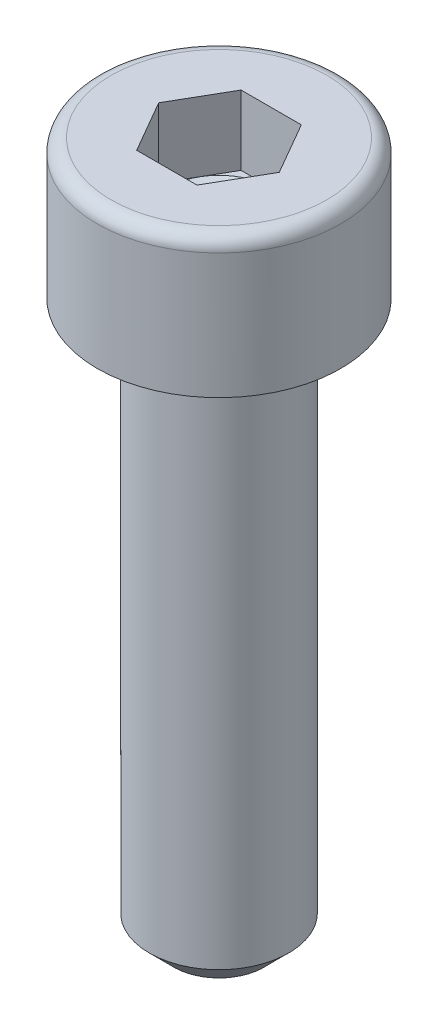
ISO-10303-21;
HEADER;
FILE_DESCRIPTION(('STEP AP214'),'2;1');
FILE_NAME('part.step','',(''),(''),'','','');
FILE_SCHEMA(('AUTOMOTIVE_DESIGN { 1 0 10303 214 1 1 1 1 }'));
ENDSEC;
DATA;
#1=APPLICATION_CONTEXT('core data for automotive mechanical design processes');
#2=APPLICATION_PROTOCOL_DEFINITION('international standard','automotive_design',2000,#1);
#3=PRODUCT_CONTEXT('',#1,'mechanical');
#4=PRODUCT('Part','Part','',(#3));
#5=PRODUCT_RELATED_PRODUCT_CATEGORY('part','',(#4));
#6=PRODUCT_DEFINITION_FORMATION('','',#4);
#7=PRODUCT_DEFINITION_CONTEXT('part definition',#1,'design');
#8=PRODUCT_DEFINITION('design','',#6,#7);
#9=PRODUCT_DEFINITION_SHAPE('','',#8);
#10=(LENGTH_UNIT() NAMED_UNIT(*) SI_UNIT(.MILLI.,.METRE.));
#11=(NAMED_UNIT(*) PLANE_ANGLE_UNIT() SI_UNIT($,.RADIAN.));
#12=(NAMED_UNIT(*) SI_UNIT($,.STERADIAN.) SOLID_ANGLE_UNIT());
#13=UNCERTAINTY_MEASURE_WITH_UNIT(LENGTH_MEASURE(1.E-05),#10,'distance_accuracy_value','');
#14=(GEOMETRIC_REPRESENTATION_CONTEXT(3) GLOBAL_UNCERTAINTY_ASSIGNED_CONTEXT((#13)) GLOBAL_UNIT_ASSIGNED_CONTEXT((#10,
#11,#12)) REPRESENTATION_CONTEXT('',''));
#15=CARTESIAN_POINT('',(0.,0.,0.));
#16=DIRECTION('',(0.,0.,1.));
#17=DIRECTION('',(1.,0.,0.));
#18=AXIS2_PLACEMENT_3D('',#15,#16,#17);
#19=CARTESIAN_POINT('',(-2.598076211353,2.,1.5));
#20=DIRECTION('',(0.,-1.,0.));
#21=DIRECTION('',(0.,0.,-1.));
#22=AXIS2_PLACEMENT_3D('',#19,#20,#21);
#23=PLANE('',#22);
#24=DIRECTION('',(-0.500000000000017,0.,0.866025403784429));
#25=VECTOR('',#24,1.);
#26=CARTESIAN_POINT('',(0.8660254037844,2.,1.5));
#27=LINE('',#26,#25);
#28=CARTESIAN_POINT('',(1.7320508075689,2.00000000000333,0.));
#29=VERTEX_POINT('',#28);
#30=CARTESIAN_POINT('',(1.29903810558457,2.00000000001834,0.750000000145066));
#31=VERTEX_POINT('',#30);
#32=EDGE_CURVE('E118',#29,#31,#27,.T.);
#33=ORIENTED_EDGE('',*,*,#32,.F.);
#34=DIRECTION('',(0.500000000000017,0.,0.866025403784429));
#35=VECTOR('',#34,1.);
#36=CARTESIAN_POINT('',(0.8660254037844,2.00000000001,-1.5));
#37=LINE('',#36,#35);
#38=CARTESIAN_POINT('',(1.29903810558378,2.00000000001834,-0.750000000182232));
#39=VERTEX_POINT('',#38);
#40=EDGE_CURVE('E117',#39,#29,#37,.T.);
#41=ORIENTED_EDGE('',*,*,#40,.F.);
#42=CARTESIAN_POINT('',(0.,2.00000000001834,0.));
#43=DIRECTION('',(0.,1.,0.));
#44=DIRECTION('',(0.,0.,1.));
#45=AXIS2_PLACEMENT_3D('',#42,#43,#44);
#46=CIRCLE('',#45,1.50000000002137);
#47=EDGE_CURVE('E93',#39,#31,#46,.F.);
#48=ORIENTED_EDGE('',*,*,#47,.T.);
#49=EDGE_LOOP('',(#33,#41,#48));
#50=FACE_BOUND('',#49,.T.);
#51=ADVANCED_FACE('F16',(#50),#23,.F.);
#52=CARTESIAN_POINT('',(-2.598076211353,2.,1.5));
#53=DIRECTION('',(0.,-1.,0.));
#54=DIRECTION('',(0.,0.,-1.));
#55=AXIS2_PLACEMENT_3D('',#52,#53,#54);
#56=PLANE('',#55);
#57=DIRECTION('',(1.,0.,0.));
#58=VECTOR('',#57,1.);
#59=CARTESIAN_POINT('',(0.8660254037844,2.000000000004,-1.5));
#60=LINE('',#59,#58);
#61=CARTESIAN_POINT('',(0.,1.99999999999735,-1.49999999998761));
#62=VERTEX_POINT('',#61);
#63=CARTESIAN_POINT('',(0.866025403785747,2.000000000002,-1.49999999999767));
#64=VERTEX_POINT('',#63);
#65=EDGE_CURVE('E113',#62,#64,#60,.T.);
#66=ORIENTED_EDGE('',*,*,#65,.F.);
#67=CARTESIAN_POINT('',(0.,2.00000000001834,0.));
#68=DIRECTION('',(0.,1.,0.));
#69=DIRECTION('',(0.,0.,1.));
#70=AXIS2_PLACEMENT_3D('',#67,#68,#69);
#71=CIRCLE('',#70,1.50000000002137);
#72=EDGE_CURVE('E98',#39,#62,#71,.T.);
#73=ORIENTED_EDGE('',*,*,#72,.F.);
#74=DIRECTION('',(0.500000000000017,0.,0.866025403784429));
#75=VECTOR('',#74,1.);
#76=CARTESIAN_POINT('',(0.8660254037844,2.,-1.5));
#77=LINE('',#76,#75);
#78=EDGE_CURVE('E110',#64,#39,#77,.T.);
#79=ORIENTED_EDGE('',*,*,#78,.F.);
#80=EDGE_LOOP('',(#66,#73,#79));
#81=FACE_BOUND('',#80,.T.);
#82=ADVANCED_FACE('F108',(#81),#56,.F.);
#83=CARTESIAN_POINT('',(0.8660254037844,2.,-1.5));
#84=DIRECTION('',(-0.866025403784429,0.,0.500000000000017));
#85=DIRECTION('',(0.500000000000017,0.,0.866025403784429));
#86=AXIS2_PLACEMENT_3D('',#83,#84,#85);
#87=PLANE('',#86);
#88=ORIENTED_EDGE('',*,*,#40,.T.);
#89=DIRECTION('',(0.,1.,0.));
#90=VECTOR('',#89,1.);
#91=CARTESIAN_POINT('',(1.73205080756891,2.,0.));
#92=LINE('',#91,#90);
#93=CARTESIAN_POINT('',(1.73205080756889,4.,0.));
#94=VERTEX_POINT('',#93);
#95=EDGE_CURVE('E137',#94,#29,#92,.F.);
#96=ORIENTED_EDGE('',*,*,#95,.F.);
#97=DIRECTION('',(0.500000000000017,0.,0.866025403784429));
#98=VECTOR('',#97,1.);
#99=CARTESIAN_POINT('',(0.8660254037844,4.,-1.5));
#100=LINE('',#99,#98);
#101=CARTESIAN_POINT('',(0.8660254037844,4.,-1.5));
#102=VERTEX_POINT('',#101);
#103=EDGE_CURVE('E115',#94,#102,#100,.F.);
#104=ORIENTED_EDGE('',*,*,#103,.T.);
#105=DIRECTION('',(0.,1.,0.));
#106=VECTOR('',#105,1.);
#107=CARTESIAN_POINT('',(0.8660254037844,2.,-1.5));
#108=LINE('',#107,#106);
#109=EDGE_CURVE('E127',#64,#102,#108,.T.);
#110=ORIENTED_EDGE('',*,*,#109,.F.);
#111=ORIENTED_EDGE('',*,*,#78,.T.);
#112=EDGE_LOOP('',(#88,#96,#104,#110,#111));
#113=FACE_BOUND('',#112,.T.);
#114=ADVANCED_FACE('F124',(#113),#87,.T.);
#115=CARTESIAN_POINT('',(0.8660254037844,2.,1.5));
#116=DIRECTION('',(-0.866025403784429,0.,-0.500000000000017));
#117=DIRECTION('',(-0.500000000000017,0.,0.866025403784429));
#118=AXIS2_PLACEMENT_3D('',#115,#116,#117);
#119=PLANE('',#118);
#120=DIRECTION('',(-0.49999999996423,0.,0.866025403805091));
#121=VECTOR('',#120,1.);
#122=CARTESIAN_POINT('',(1.299038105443,2.,0.7500000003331));
#123=LINE('',#122,#121);
#124=CARTESIAN_POINT('',(0.8660254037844,2.,1.5));
#125=VERTEX_POINT('',#124);
#126=EDGE_CURVE('E169',#31,#125,#123,.T.);
#127=ORIENTED_EDGE('',*,*,#126,.T.);
#128=DIRECTION('',(0.,1.,0.));
#129=VECTOR('',#128,1.);
#130=CARTESIAN_POINT('',(0.8660254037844,2.,1.5));
#131=LINE('',#130,#129);
#132=CARTESIAN_POINT('',(0.8660254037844,4.,1.5));
#133=VERTEX_POINT('',#132);
#134=EDGE_CURVE('E261',#133,#125,#131,.F.);
#135=ORIENTED_EDGE('',*,*,#134,.F.);
#136=DIRECTION('',(-0.500000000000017,0.,0.866025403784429));
#137=VECTOR('',#136,1.);
#138=CARTESIAN_POINT('',(0.8660254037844,4.,1.5));
#139=LINE('',#138,#137);
#140=EDGE_CURVE('E122',#133,#94,#139,.F.);
#141=ORIENTED_EDGE('',*,*,#140,.T.);
#142=ORIENTED_EDGE('',*,*,#95,.T.);
#143=ORIENTED_EDGE('',*,*,#32,.T.);
#144=EDGE_LOOP('',(#127,#135,#141,#142,#143));
#145=FACE_BOUND('',#144,.T.);
#146=ADVANCED_FACE('F316',(#145),#119,.T.);
#147=CARTESIAN_POINT('',(-2.598076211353,2.,1.5));
#148=DIRECTION('',(0.,-1.,0.));
#149=DIRECTION('',(0.,0.,-1.));
#150=AXIS2_PLACEMENT_3D('',#147,#148,#149);
#151=PLANE('',#150);
#152=ORIENTED_EDGE('',*,*,#126,.F.);
#153=CARTESIAN_POINT('',(0.,2.00000000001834,0.));
#154=DIRECTION('',(0.,1.,0.));
#155=DIRECTION('',(0.,0.,1.));
#156=AXIS2_PLACEMENT_3D('',#153,#154,#155);
#157=CIRCLE('',#156,1.50000000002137);
#158=CARTESIAN_POINT('',(2.02718755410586E-10,1.99999999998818,1.49999999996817));
#159=VERTEX_POINT('',#158);
#160=EDGE_CURVE('E100',#159,#31,#157,.T.);
#161=ORIENTED_EDGE('',*,*,#160,.F.);
#162=DIRECTION('',(-1.,0.,0.));
#163=VECTOR('',#162,1.);
#164=CARTESIAN_POINT('',(0.8660254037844,2.,1.5));
#165=LINE('',#164,#163);
#166=EDGE_CURVE('E167',#125,#159,#165,.T.);
#167=ORIENTED_EDGE('',*,*,#166,.F.);
#168=EDGE_LOOP('',(#152,#161,#167));
#169=FACE_BOUND('',#168,.T.);
#170=ADVANCED_FACE('F314',(#169),#151,.F.);
#171=CARTESIAN_POINT('',(0.,1.99999999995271,0.));
#172=DIRECTION('',(0.,1.,0.));
#173=DIRECTION('',(0.,0.,1.));
#174=AXIS2_PLACEMENT_3D('',#171,#172,#173);
#175=CONICAL_SURFACE('',#174,1.49999999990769,1.04719755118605);
#176=CARTESIAN_POINT('',(0.,2.00000000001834,0.));
#177=DIRECTION('',(0.,1.,0.));
#178=DIRECTION('',(0.,0.,1.));
#179=AXIS2_PLACEMENT_3D('',#176,#177,#178);
#180=CIRCLE('',#179,1.50000000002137);
#181=CARTESIAN_POINT('',(-1.29903810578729,2.00000000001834,0.749999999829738));
#182=VERTEX_POINT('',#181);
#183=EDGE_CURVE('E165',#182,#159,#180,.T.);
#184=ORIENTED_EDGE('',*,*,#183,.T.);
#185=ORIENTED_EDGE('',*,*,#160,.T.);
#186=ORIENTED_EDGE('',*,*,#47,.F.);
#187=ORIENTED_EDGE('',*,*,#72,.T.);
#188=CARTESIAN_POINT('',(0.,2.00000000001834,0.));
#189=DIRECTION('',(0.,1.,0.));
#190=DIRECTION('',(0.,0.,1.));
#191=AXIS2_PLACEMENT_3D('',#188,#189,#190);
#192=CIRCLE('',#191,1.50000000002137);
#193=CARTESIAN_POINT('',(-1.29903810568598,2.00000000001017,-0.750000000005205));
#194=VERTEX_POINT('',#193);
#195=EDGE_CURVE('E151',#62,#194,#192,.T.);
#196=ORIENTED_EDGE('',*,*,#195,.T.);
#197=CARTESIAN_POINT('',(0.,2.00000000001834,0.));
#198=DIRECTION('',(0.,1.,0.));
#199=DIRECTION('',(0.,0.,1.));
#200=AXIS2_PLACEMENT_3D('',#197,#198,#199);
#201=CIRCLE('',#200,1.50000000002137);
#202=EDGE_CURVE('E161',#194,#182,#201,.T.);
#203=ORIENTED_EDGE('',*,*,#202,.T.);
#204=EDGE_LOOP('',(#184,#185,#186,#187,#196,#203));
#205=FACE_BOUND('',#204,.T.);
#206=CARTESIAN_POINT('',(0.,1.13397459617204,1.4210854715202E-10));
#207=VERTEX_POINT('',#206);
#208=VERTEX_LOOP('',#207);
#209=FACE_BOUND('',#208,.T.);
#210=ADVANCED_FACE('F96',(#205,#209),#175,.F.);
#211=CARTESIAN_POINT('',(-2.598076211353,2.,1.5));
#212=DIRECTION('',(0.,-1.,0.));
#213=DIRECTION('',(0.,0.,-1.));
#214=AXIS2_PLACEMENT_3D('',#211,#212,#213);
#215=PLANE('',#214);
#216=DIRECTION('',(0.500000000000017,0.,-0.866025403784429));
#217=VECTOR('',#216,1.);
#218=CARTESIAN_POINT('',(-0.8660254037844,2.000000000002,-1.5));
#219=LINE('',#218,#217);
#220=CARTESIAN_POINT('',(-0.8660254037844,2.000000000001,-1.5));
#221=VERTEX_POINT('',#220);
#222=EDGE_CURVE('E250',#194,#221,#219,.T.);
#223=ORIENTED_EDGE('',*,*,#222,.F.);
#224=ORIENTED_EDGE('',*,*,#195,.F.);
#225=DIRECTION('',(1.,0.,0.));
#226=VECTOR('',#225,1.);
#227=CARTESIAN_POINT('',(0.8660254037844,2.,-1.5));
#228=LINE('',#227,#226);
#229=EDGE_CURVE('E150',#221,#62,#228,.T.);
#230=ORIENTED_EDGE('',*,*,#229,.F.);
#231=EDGE_LOOP('',(#223,#224,#230));
#232=FACE_BOUND('',#231,.T.);
#233=ADVANCED_FACE('F298',(#232),#215,.F.);
#234=CARTESIAN_POINT('',(0.8660254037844,2.,-1.5));
#235=DIRECTION('',(0.,0.,1.));
#236=DIRECTION('',(1.,0.,0.));
#237=AXIS2_PLACEMENT_3D('',#234,#235,#236);
#238=PLANE('',#237);
#239=ORIENTED_EDGE('',*,*,#65,.T.);
#240=ORIENTED_EDGE('',*,*,#109,.T.);
#241=DIRECTION('',(1.,0.,0.));
#242=VECTOR('',#241,1.);
#243=CARTESIAN_POINT('',(0.8660254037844,4.,-1.5));
#244=LINE('',#243,#242);
#245=CARTESIAN_POINT('',(-0.8660254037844,4.,-1.5));
#246=VERTEX_POINT('',#245);
#247=EDGE_CURVE('E147',#102,#246,#244,.F.);
#248=ORIENTED_EDGE('',*,*,#247,.T.);
#249=DIRECTION('',(0.,1.,0.));
#250=VECTOR('',#249,1.);
#251=CARTESIAN_POINT('',(-0.8660254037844,2.,-1.5));
#252=LINE('',#251,#250);
#253=EDGE_CURVE('E255',#221,#246,#252,.T.);
#254=ORIENTED_EDGE('',*,*,#253,.F.);
#255=ORIENTED_EDGE('',*,*,#229,.T.);
#256=EDGE_LOOP('',(#239,#240,#248,#254,#255));
#257=FACE_BOUND('',#256,.T.);
#258=ADVANCED_FACE('F294',(#257),#238,.T.);
#259=CARTESIAN_POINT('',(0.8660254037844,2.,1.5));
#260=DIRECTION('',(0.,0.,-1.));
#261=DIRECTION('',(-1.,0.,0.));
#262=AXIS2_PLACEMENT_3D('',#259,#260,#261);
#263=PLANE('',#262);
#264=DIRECTION('',(1.,0.,0.));
#265=VECTOR('',#264,1.);
#266=CARTESIAN_POINT('',(-2.598076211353,2.,1.499999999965));
#267=LINE('',#266,#265);
#268=CARTESIAN_POINT('',(-0.866025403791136,2.,1.49999999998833));
#269=VERTEX_POINT('',#268);
#270=EDGE_CURVE('E164',#159,#269,#267,.F.);
#271=ORIENTED_EDGE('',*,*,#270,.T.);
#272=DIRECTION('',(0.,1.,0.));
#273=VECTOR('',#272,1.);
#274=CARTESIAN_POINT('',(-0.8660254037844,2.,1.5));
#275=LINE('',#274,#273);
#276=CARTESIAN_POINT('',(-0.8660254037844,4.,1.5));
#277=VERTEX_POINT('',#276);
#278=EDGE_CURVE('E235',#277,#269,#275,.F.);
#279=ORIENTED_EDGE('',*,*,#278,.F.);
#280=DIRECTION('',(-1.,0.,0.));
#281=VECTOR('',#280,1.);
#282=CARTESIAN_POINT('',(0.8660254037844,4.,1.5));
#283=LINE('',#282,#281);
#284=EDGE_CURVE('E258',#277,#133,#283,.F.);
#285=ORIENTED_EDGE('',*,*,#284,.T.);
#286=ORIENTED_EDGE('',*,*,#134,.T.);
#287=ORIENTED_EDGE('',*,*,#166,.T.);
#288=EDGE_LOOP('',(#271,#279,#285,#286,#287));
#289=FACE_BOUND('',#288,.T.);
#290=ADVANCED_FACE('F312',(#289),#263,.T.);
#291=CARTESIAN_POINT('',(-2.598076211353,2.,1.5));
#292=DIRECTION('',(0.,-1.,0.));
#293=DIRECTION('',(0.,0.,-1.));
#294=AXIS2_PLACEMENT_3D('',#291,#292,#293);
#295=PLANE('',#294);
#296=ORIENTED_EDGE('',*,*,#270,.F.);
#297=ORIENTED_EDGE('',*,*,#183,.F.);
#298=DIRECTION('',(-0.500000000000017,0.,-0.866025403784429));
#299=VECTOR('',#298,1.);
#300=CARTESIAN_POINT('',(-0.8660254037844,2.,1.5));
#301=LINE('',#300,#299);
#302=EDGE_CURVE('E226',#269,#182,#301,.T.);
#303=ORIENTED_EDGE('',*,*,#302,.F.);
#304=EDGE_LOOP('',(#296,#297,#303));
#305=FACE_BOUND('',#304,.T.);
#306=ADVANCED_FACE('F310',(#305),#295,.F.);
#307=CARTESIAN_POINT('',(-2.598076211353,2.,1.5));
#308=DIRECTION('',(0.,-1.,0.));
#309=DIRECTION('',(0.,0.,-1.));
#310=AXIS2_PLACEMENT_3D('',#307,#308,#309);
#311=PLANE('',#310);
#312=DIRECTION('',(-0.500000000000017,0.,-0.866025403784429));
#313=VECTOR('',#312,1.);
#314=CARTESIAN_POINT('',(-0.8660254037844,2.00000000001,1.5));
#315=LINE('',#314,#313);
#316=CARTESIAN_POINT('',(-1.7320508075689,2.000000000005,0.));
#317=VERTEX_POINT('',#316);
#318=EDGE_CURVE('E234',#182,#317,#315,.T.);
#319=ORIENTED_EDGE('',*,*,#318,.F.);
#320=ORIENTED_EDGE('',*,*,#202,.F.);
#321=DIRECTION('',(0.500000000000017,0.,-0.866025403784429));
#322=VECTOR('',#321,1.);
#323=CARTESIAN_POINT('',(-0.8660254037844,2.,-1.5));
#324=LINE('',#323,#322);
#325=EDGE_CURVE('E183',#317,#194,#324,.T.);
#326=ORIENTED_EDGE('',*,*,#325,.F.);
#327=EDGE_LOOP('',(#319,#320,#326));
#328=FACE_BOUND('',#327,.T.);
#329=ADVANCED_FACE('F303',(#328),#311,.F.);
#330=CARTESIAN_POINT('',(-0.8660254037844,2.,-1.5));
#331=DIRECTION('',(0.866025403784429,0.,0.500000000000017));
#332=DIRECTION('',(0.500000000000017,0.,-0.866025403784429));
#333=AXIS2_PLACEMENT_3D('',#330,#331,#332);
#334=PLANE('',#333);
#335=ORIENTED_EDGE('',*,*,#222,.T.);
#336=ORIENTED_EDGE('',*,*,#253,.T.);
#337=DIRECTION('',(0.500000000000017,0.,-0.866025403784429));
#338=VECTOR('',#337,1.);
#339=CARTESIAN_POINT('',(-0.8660254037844,4.,-1.5));
#340=LINE('',#339,#338);
#341=CARTESIAN_POINT('',(-1.73205080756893,4.,0.));
#342=VERTEX_POINT('',#341);
#343=EDGE_CURVE('E163',#246,#342,#340,.F.);
#344=ORIENTED_EDGE('',*,*,#343,.T.);
#345=DIRECTION('',(0.,1.,0.));
#346=VECTOR('',#345,1.);
#347=CARTESIAN_POINT('',(-1.73205080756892,2.,0.));
#348=LINE('',#347,#346);
#349=EDGE_CURVE('E240',#317,#342,#348,.T.);
#350=ORIENTED_EDGE('',*,*,#349,.F.);
#351=ORIENTED_EDGE('',*,*,#325,.T.);
#352=EDGE_LOOP('',(#335,#336,#344,#350,#351));
#353=FACE_BOUND('',#352,.T.);
#354=ADVANCED_FACE('F371',(#353),#334,.T.);
#355=CARTESIAN_POINT('',(-0.8660254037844,2.,1.5));
#356=DIRECTION('',(0.866025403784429,0.,-0.500000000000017));
#357=DIRECTION('',(-0.500000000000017,0.,-0.866025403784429));
#358=AXIS2_PLACEMENT_3D('',#355,#356,#357);
#359=PLANE('',#358);
#360=ORIENTED_EDGE('',*,*,#318,.T.);
#361=ORIENTED_EDGE('',*,*,#349,.T.);
#362=DIRECTION('',(0.500000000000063,0.,0.866025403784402));
#363=VECTOR('',#362,1.);
#364=CARTESIAN_POINT('',(-1.732050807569,4.,0.));
#365=LINE('',#364,#363);
#366=EDGE_CURVE('E245',#342,#277,#365,.T.);
#367=ORIENTED_EDGE('',*,*,#366,.T.);
#368=ORIENTED_EDGE('',*,*,#278,.T.);
#369=ORIENTED_EDGE('',*,*,#302,.T.);
#370=EDGE_LOOP('',(#360,#361,#367,#368,#369));
#371=FACE_BOUND('',#370,.T.);
#372=ADVANCED_FACE('F201',(#371),#359,.T.);
#373=CARTESIAN_POINT('',(1.5,4.,0.));
#374=DIRECTION('',(0.,-1.,0.));
#375=DIRECTION('',(0.,0.,-1.));
#376=AXIS2_PLACEMENT_3D('',#373,#374,#375);
#377=PLANE('',#376);
#378=ORIENTED_EDGE('',*,*,#343,.F.);
#379=ORIENTED_EDGE('',*,*,#247,.F.);
#380=ORIENTED_EDGE('',*,*,#103,.F.);
#381=ORIENTED_EDGE('',*,*,#140,.F.);
#382=ORIENTED_EDGE('',*,*,#284,.F.);
#383=ORIENTED_EDGE('',*,*,#366,.F.);
#384=EDGE_LOOP('',(#378,#379,#380,#381,#382,#383));
#385=FACE_BOUND('',#384,.T.);
#386=CARTESIAN_POINT('',(3.1,4.,0.));
#387=CARTESIAN_POINT('',(3.09999204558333,3.99999999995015,0.0555987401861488));
#388=CARTESIAN_POINT('',(3.09848704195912,3.99999999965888,0.111197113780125));
#389=CARTESIAN_POINT('',(3.09249410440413,3.99999999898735,0.222232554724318));
#390=CARTESIAN_POINT('',(3.08800618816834,3.9999999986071,0.277669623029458));
#391=CARTESIAN_POINT('',(3.07605860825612,3.99999999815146,0.38822240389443));
#392=CARTESIAN_POINT('',(3.06859895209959,3.99999999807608,0.443338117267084));
#393=CARTESIAN_POINT('',(3.05072978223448,3.99999999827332,0.553089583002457));
#394=CARTESIAN_POINT('',(3.04032026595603,3.99999999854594,0.607725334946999));
#395=CARTESIAN_POINT('',(3.01658175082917,3.9999999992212,0.716358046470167));
#396=CARTESIAN_POINT('',(3.00325273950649,3.99999999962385,0.770355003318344));
#397=CARTESIAN_POINT('',(2.97371186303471,4.00000000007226,0.877559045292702));
#398=CARTESIAN_POINT('',(2.95749997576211,4.00000000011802,0.930766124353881));
#399=CARTESIAN_POINT('',(2.93282216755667,3.99999999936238,1.00458540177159));
#400=CARTESIAN_POINT('',(2.92554443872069,3.99999999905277,1.02560133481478));
#401=CARTESIAN_POINT('',(2.90628357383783,3.99999999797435,1.07934445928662));
#402=CARTESIAN_POINT('',(2.89397229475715,3.9999999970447,1.11195515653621));
#403=CARTESIAN_POINT('',(2.8686581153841,3.99999999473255,1.17573237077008));
#404=CARTESIAN_POINT('',(2.8556886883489,3.99999999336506,1.20691223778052));
#405=CARTESIAN_POINT('',(2.82071663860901,3.99999998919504,1.28726058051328));
#406=CARTESIAN_POINT('',(2.79793158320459,3.99999998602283,1.33609138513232));
#407=CARTESIAN_POINT('',(2.75119506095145,3.99999997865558,1.42979914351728));
#408=CARTESIAN_POINT('',(2.72738022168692,3.99999997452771,1.47474443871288));
#409=CARTESIAN_POINT('',(2.67904527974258,3.9999999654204,1.56078124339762));
#410=CARTESIAN_POINT('',(2.65465068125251,3.99999996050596,1.6019432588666));
#411=CARTESIAN_POINT('',(2.60557999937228,3.99999994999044,1.68053673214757));
#412=CARTESIAN_POINT('',(2.58101854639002,3.99999994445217,1.71803981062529));
#413=CARTESIAN_POINT('',(2.53199911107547,3.99999993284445,1.78945986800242));
#414=CARTESIAN_POINT('',(2.50764530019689,3.99999992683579,1.82344837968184));
#415=CARTESIAN_POINT('',(2.45938866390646,3.99999991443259,1.88799769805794));
#416=CARTESIAN_POINT('',(2.43557998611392,3.99999990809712,1.91862892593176));
#417=CARTESIAN_POINT('',(2.38872492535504,3.99999989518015,1.97663079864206));
#418=CARTESIAN_POINT('',(2.36576314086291,3.99999988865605,2.00406981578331));
#419=CARTESIAN_POINT('',(2.32087882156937,3.99999987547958,2.05585802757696));
#420=CARTESIAN_POINT('',(2.2990318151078,3.99999986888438,2.08027272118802));
#421=CARTESIAN_POINT('',(2.25662118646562,3.99999985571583,2.12618261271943));
#422=CARTESIAN_POINT('',(2.2361245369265,3.99999984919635,2.14773968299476));
#423=CARTESIAN_POINT('',(2.19662924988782,3.99999983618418,2.18809948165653));
#424=CARTESIAN_POINT('',(2.17768941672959,3.99999982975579,2.20695987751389));
#425=CARTESIAN_POINT('',(2.12663984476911,3.9999998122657,2.25649699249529));
#426=CARTESIAN_POINT('',(2.09410501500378,3.99999980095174,2.2867382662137));
#427=CARTESIAN_POINT('',(2.03678010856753,3.99999977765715,2.33777427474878));
#428=CARTESIAN_POINT('',(2.01228673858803,3.99999976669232,2.35890375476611));
#429=CARTESIAN_POINT('',(1.97190590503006,3.99999975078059,2.39264865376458));
#430=CARTESIAN_POINT('',(1.95621572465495,3.99999974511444,2.40550043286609));
#431=CARTESIAN_POINT('',(1.93399799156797,3.99999972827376,2.42334689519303));
#432=CARTESIAN_POINT('',(1.92757169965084,3.99999972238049,2.42846802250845));
#433=CARTESIAN_POINT('',(1.90392604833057,3.99999970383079,2.44715456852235));
#434=CARTESIAN_POINT('',(1.88657982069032,3.99999969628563,2.46055971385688));
#435=CARTESIAN_POINT('',(1.83452671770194,3.99999969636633,2.49988858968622));
#436=CARTESIAN_POINT('',(1.79940012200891,3.99999972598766,2.52526048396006));
#437=CARTESIAN_POINT('',(1.73933808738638,3.9999997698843,2.56675820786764));
#438=CARTESIAN_POINT('',(1.71467484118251,3.99999978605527,2.58328073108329));
#439=CARTESIAN_POINT('',(1.66039556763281,3.9999998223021,2.61852132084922));
#440=CARTESIAN_POINT('',(1.63068783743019,3.99999984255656,2.63709857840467));
#441=CARTESIAN_POINT('',(1.56607744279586,3.99999988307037,2.67599250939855));
#442=CARTESIAN_POINT('',(1.5310740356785,3.99999990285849,2.69614180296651));
#443=CARTESIAN_POINT('',(1.45561837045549,3.99999994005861,2.73763347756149));
#444=CARTESIAN_POINT('',(1.41505835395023,3.99999995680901,2.75878053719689));
#445=CARTESIAN_POINT('',(1.34846695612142,3.99999997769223,2.79164645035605));
#446=CARTESIAN_POINT('',(1.32270761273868,3.99999998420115,2.80392038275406));
#447=CARTESIAN_POINT('',(1.26927192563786,3.9999999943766,2.82848058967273));
#448=CARTESIAN_POINT('',(1.24157472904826,3.99999999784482,2.84072166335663));
#449=CARTESIAN_POINT('',(1.19157953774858,4.00000000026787,2.86195168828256));
#450=CARTESIAN_POINT('',(1.16934500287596,4.00000000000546,2.87109101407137));
#451=CARTESIAN_POINT('',(1.09489208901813,3.99999999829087,2.90069791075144));
#452=CARTESIAN_POINT('',(1.04221460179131,3.99999999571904,2.9200259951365));
#453=CARTESIAN_POINT('',(0.935901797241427,3.99999999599,2.95582520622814));
#454=CARTESIAN_POINT('',(0.882266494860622,3.99999999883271,2.97229637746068));
#455=CARTESIAN_POINT('',(0.774188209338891,4.00000000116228,3.00233273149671));
#456=CARTESIAN_POINT('',(0.719745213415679,4.00000000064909,3.01589786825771));
#457=CARTESIAN_POINT('',(0.602381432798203,3.99999993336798,3.04182962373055));
#458=CARTESIAN_POINT('',(0.539360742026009,3.99999985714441,3.05374809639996));
#459=CARTESIAN_POINT('',(0.428761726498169,3.9999996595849,3.07111175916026));
#460=CARTESIAN_POINT('',(0.381318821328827,3.99999955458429,3.07743202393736));
#461=CARTESIAN_POINT('',(0.278257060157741,3.99999944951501,3.08865903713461));
#462=CARTESIAN_POINT('',(0.22259281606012,3.99999946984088,3.09315490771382));
#463=CARTESIAN_POINT('',(0.111105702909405,3.99999962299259,3.09906487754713));
#464=CARTESIAN_POINT('',(0.0552828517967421,3.99999975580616,3.10047931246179));
#465=CARTESIAN_POINT('',(-0.0324232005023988,3.99999992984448,3.10023947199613));
#466=CARTESIAN_POINT('',(-0.0643123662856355,3.9999999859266,3.09964061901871));
#467=CARTESIAN_POINT('',(-0.1200282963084,4.00000000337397,3.0977598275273));
#468=CARTESIAN_POINT('',(-0.143862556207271,3.9999999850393,3.09668795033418));
#469=CARTESIAN_POINT('',(-0.223248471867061,3.99999999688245,3.09228203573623));
#470=CARTESIAN_POINT('',(-0.278743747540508,4.0000001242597,3.08783686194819));
#471=CARTESIAN_POINT('',(-0.349913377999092,3.99999992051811,3.08047421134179));
#472=CARTESIAN_POINT('',(-0.365716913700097,3.99999985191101,3.07873351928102));
#473=CARTESIAN_POINT('',(-0.403793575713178,3.99999972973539,3.07415977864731));
#474=CARTESIAN_POINT('',(-0.426048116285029,3.9999996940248,3.07117222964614));
#475=CARTESIAN_POINT('',(-0.519925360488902,3.99999960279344,3.05749846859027));
#476=CARTESIAN_POINT('',(-0.591225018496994,3.99999967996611,3.04447221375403));
#477=CARTESIAN_POINT('',(-0.701152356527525,3.99999975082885,3.02039474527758));
#478=CARTESIAN_POINT('',(-0.74016824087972,3.99999976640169,3.011054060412));
#479=CARTESIAN_POINT('',(-0.824753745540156,3.99999978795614,2.98907427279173));
#480=CARTESIAN_POINT('',(-0.87024840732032,3.99999979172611,2.97614402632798));
#481=CARTESIAN_POINT('',(-0.96745379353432,3.99999979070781,2.94610542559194));
#482=CARTESIAN_POINT('',(-1.01906111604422,3.99999978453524,2.92866083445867));
#483=CARTESIAN_POINT('',(-1.09825080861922,3.99999976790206,2.89955381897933));
#484=CARTESIAN_POINT('',(-1.12618111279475,3.99999976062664,2.88882761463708));
#485=CARTESIAN_POINT('',(-1.18338545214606,3.99999974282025,2.86590599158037));
#486=CARTESIAN_POINT('',(-1.21263970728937,3.99999973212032,2.85366104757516));
#487=CARTESIAN_POINT('',(-1.27240252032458,3.99999970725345,2.8275635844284));
#488=CARTESIAN_POINT('',(-1.30288847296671,3.99999969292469,2.81365931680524));
#489=CARTESIAN_POINT('',(-1.36501415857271,3.99999965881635,2.78410169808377));
#490=CARTESIAN_POINT('',(-1.39662831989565,3.99999963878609,2.76839456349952));
#491=CARTESIAN_POINT('',(-1.46089360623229,3.9999995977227,2.73508416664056));
#492=CARTESIAN_POINT('',(-1.49351581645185,3.99999957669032,2.71742511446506));
#493=CARTESIAN_POINT('',(-1.55967331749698,3.99999951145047,2.68007599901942));
#494=CARTESIAN_POINT('',(-1.59317649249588,3.99999946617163,2.66032901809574));
#495=CARTESIAN_POINT('',(-1.66046519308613,3.99999943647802,2.61889913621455));
#496=CARTESIAN_POINT('',(-1.69422497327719,3.99999945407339,2.59717433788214));
#497=CARTESIAN_POINT('',(-1.7504049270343,3.99999952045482,2.55943011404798));
#498=CARTESIAN_POINT('',(-1.77306007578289,3.99999955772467,2.54375883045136));
#499=CARTESIAN_POINT('',(-1.82200170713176,3.99999964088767,2.50892343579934));
#500=CARTESIAN_POINT('',(-1.84820365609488,3.99999968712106,2.48964033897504));
#501=CARTESIAN_POINT('',(-1.90395183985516,3.99999978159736,2.44724011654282));
#502=CARTESIAN_POINT('',(-1.9333955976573,3.9999998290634,2.42398813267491));
#503=CARTESIAN_POINT('',(-1.99526135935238,3.99999991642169,2.373259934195));
#504=CARTESIAN_POINT('',(-2.02755963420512,3.99999995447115,2.34563279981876));
#505=CARTESIAN_POINT('',(-2.09232478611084,3.99999999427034,2.28795223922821));
#506=CARTESIAN_POINT('',(-2.12474446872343,3.99999999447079,2.25784578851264));
#507=CARTESIAN_POINT('',(-2.17683170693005,3.99999999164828,2.20741683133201));
#508=CARTESIAN_POINT('',(-2.19687881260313,3.99999998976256,2.18748470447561));
#509=CARTESIAN_POINT('',(-2.23929662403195,3.9999999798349,2.14415477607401));
#510=CARTESIAN_POINT('',(-2.26158246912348,3.99999997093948,2.12067371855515));
#511=CARTESIAN_POINT('',(-2.30819204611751,3.99999994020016,2.07001282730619));
#512=CARTESIAN_POINT('',(-2.33241615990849,3.99999991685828,2.04274133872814));
#513=CARTESIAN_POINT('',(-2.38256656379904,3.99999984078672,1.98425214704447));
#514=CARTESIAN_POINT('',(-2.4083778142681,3.99999978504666,1.95293561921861));
#515=CARTESIAN_POINT('',(-2.45203502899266,3.99999966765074,1.89779286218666));
#516=CARTESIAN_POINT('',(-2.47017029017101,3.99999961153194,1.87419508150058));
#517=CARTESIAN_POINT('',(-2.50574537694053,3.99999950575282,1.82648068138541));
#518=CARTESIAN_POINT('',(-2.52318518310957,3.99999945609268,1.80236404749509));
#519=CARTESIAN_POINT('',(-2.57444163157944,3.9999993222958,1.72926815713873));
#520=CARTESIAN_POINT('',(-2.60719830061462,3.99999925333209,1.67953912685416));
#521=CARTESIAN_POINT('',(-2.66976247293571,3.99999918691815,1.57826325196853));
#522=CARTESIAN_POINT('',(-2.69956996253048,3.99999918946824,1.52671639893));
#523=CARTESIAN_POINT('',(-2.75613544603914,3.99999926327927,1.42197673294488));
#524=CARTESIAN_POINT('',(-2.782893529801,3.99999933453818,1.36878396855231));
#525=CARTESIAN_POINT('',(-2.83327449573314,3.99999952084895,1.2609383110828));
#526=CARTESIAN_POINT('',(-2.85689757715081,3.99999963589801,1.20628551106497));
#527=CARTESIAN_POINT('',(-2.90090444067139,3.99999983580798,1.09569562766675));
#528=CARTESIAN_POINT('',(-2.92128853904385,3.99999992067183,1.03975867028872));
#529=CARTESIAN_POINT('',(-2.95757860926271,4.00000002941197,0.930620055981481));
#530=CARTESIAN_POINT('',(-2.97369346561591,4.00000005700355,0.877487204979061));
#531=CARTESIAN_POINT('',(-3.00336610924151,3.99999993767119,0.770512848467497));
#532=CARTESIAN_POINT('',(-3.01692424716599,3.9999997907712,0.716671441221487));
#533=CARTESIAN_POINT('',(-3.03641892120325,3.99999965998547,0.62829610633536));
#534=CARTESIAN_POINT('',(-3.04332104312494,3.99999963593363,0.593974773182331));
#535=CARTESIAN_POINT('',(-3.05552494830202,3.99999965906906,0.527300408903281));
#536=CARTESIAN_POINT('',(-3.06090052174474,3.99999970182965,0.494960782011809));
#537=CARTESIAN_POINT('',(-3.07212525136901,3.99999979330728,0.420054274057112));
#538=CARTESIAN_POINT('',(-3.07760277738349,3.99999983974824,0.377431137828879));
#539=CARTESIAN_POINT('',(-3.0864654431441,3.99999991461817,0.294912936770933));
#540=CARTESIAN_POINT('',(-3.08996795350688,3.99999994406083,0.255030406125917));
#541=CARTESIAN_POINT('',(-3.09488214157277,3.99999997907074,0.183197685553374));
#542=CARTESIAN_POINT('',(-3.09657273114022,3.99999998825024,0.151266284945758));
#543=CARTESIAN_POINT('',(-3.09927064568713,4.0000000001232,0.0795637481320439));
#544=CARTESIAN_POINT('',(-3.10001029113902,4.00000000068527,0.0397823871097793));
#545=CARTESIAN_POINT('',(-3.1,4.,0.));
#546=B_SPLINE_CURVE_WITH_KNOTS('',3,(#386,#387,#388,#389,#390,#391,#392,#393,#394,#395,#396,
#397,#398,#399,#400,#401,#402,#403,#404,#405,#406,#407,#408,#409,#410,#411,#412,#413,#414,#415,
#416,#417,#418,#419,#420,#421,#422,#423,#424,#425,#426,#427,#428,#429,#430,#431,#432,#433,#434,
#435,#436,#437,#438,#439,#440,#441,#442,#443,#444,#445,#446,#447,#448,#449,#450,#451,#452,#453,
#454,#455,#456,#457,#458,#459,#460,#461,#462,#463,#464,#465,#466,#467,#468,#469,#470,#471,#472,
#473,#474,#475,#476,#477,#478,#479,#480,#481,#482,#483,#484,#485,#486,#487,#488,#489,#490,#491,
#492,#493,#494,#495,#496,#497,#498,#499,#500,#501,#502,#503,#504,#505,#506,#507,#508,#509,#510,
#511,#512,#513,#514,#515,#516,#517,#518,#519,#520,#521,#522,#523,#524,#525,#526,#527,#528,#529,
#530,#531,#532,#533,#534,#535,#536,#537,#538,#539,#540,#541,#542,#543,#544,#545),.UNSPECIFIED.,
.F.,.F.,(4,2,2,2,2,2,2,2,2,2,2,2,2,2,2,2,2,2,2,2,2,2,2,2,2,2,2,2,2,2,2,2,2,2,2,2,2,2,2,2,2,2,2,
2,2,2,2,2,2,2,2,2,2,2,2,2,2,2,2,2,2,2,2,2,2,2,2,2,2,2,2,2,2,2,2,2,2,2,2,4),(0.,
0.166775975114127,0.333550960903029,0.500325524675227,0.667100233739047,0.833875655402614,
1.00065235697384,1.06737026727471,1.17191935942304,1.27321294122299,1.4347891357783,
1.58732338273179,1.73081505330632,1.86526355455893,1.99066832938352,2.10702885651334,
2.21434465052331,2.31261526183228,2.40184027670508,2.48201931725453,2.61523049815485,
2.71225885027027,2.77310016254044,2.79775172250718,2.8635141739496,2.99346345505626,
3.08251171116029,3.1876047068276,3.30874052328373,3.44591688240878,3.53150984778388,
3.62234023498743,3.694454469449,3.86269957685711,4.0309420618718,4.19918721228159,
4.39147035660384,4.53500730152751,4.70245601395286,4.8698864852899,4.96555607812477,
5.03712721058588,5.20406854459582,5.25176430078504,5.319121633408,5.53633997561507,
5.65667293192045,5.79851248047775,5.96185814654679,6.05160504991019,6.14673027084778,
6.24723407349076,6.35311675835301,6.46437866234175,6.58102015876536,6.70142370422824,
6.78405619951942,6.88163793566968,6.99416618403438,7.12163759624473,7.25432575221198,
7.33912591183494,7.43622919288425,7.54563723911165,7.66735217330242,7.7566242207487,
7.84589875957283,8.02443337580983,8.2029688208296,8.38149900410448,8.56001783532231,
8.73851922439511,8.90502473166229,9.07150738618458,9.17650944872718,9.2748439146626,
9.40372555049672,9.52380335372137,9.61971744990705,9.73905442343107),.UNSPECIFIED.);
#547=CARTESIAN_POINT('',(3.1,4.,0.));
#548=VERTEX_POINT('',#547);
#549=CARTESIAN_POINT('',(-3.1,4.,0.));
#550=VERTEX_POINT('',#549);
#551=EDGE_CURVE('E36',#548,#550,#546,.T.);
#552=ORIENTED_EDGE('',*,*,#551,.F.);
#553=CARTESIAN_POINT('',(0.,4.,0.));
#554=DIRECTION('',(0.,-1.,0.));
#555=DIRECTION('',(-1.,0.,0.));
#556=AXIS2_PLACEMENT_3D('',#553,#554,#555);
#557=CIRCLE('',#556,3.1);
#558=EDGE_CURVE('E221',#550,#548,#557,.T.);
#559=ORIENTED_EDGE('',*,*,#558,.F.);
#560=EDGE_LOOP('',(#552,#559));
#561=FACE_BOUND('',#560,.T.);
#562=ADVANCED_FACE('F191',(#385,#561),#377,.F.);
#563=CARTESIAN_POINT('',(0.,3.6,0.));
#564=DIRECTION('',(0.,-1.,0.));
#565=DIRECTION('',(1.,0.,0.));
#566=AXIS2_PLACEMENT_3D('',#563,#564,#565);
#567=TOROIDAL_SURFACE('',#566,3.1,0.4);
#568=CARTESIAN_POINT('',(0.,3.6,0.));
#569=DIRECTION('',(0.,1.,0.));
#570=DIRECTION('',(0.,0.,1.));
#571=AXIS2_PLACEMENT_3D('',#568,#569,#570);
#572=CIRCLE('',#571,3.5);
#573=CARTESIAN_POINT('',(0.,3.6,3.5));
#574=VERTEX_POINT('',#573);
#575=EDGE_CURVE('E160',#574,#574,#572,.F.);
#576=ORIENTED_EDGE('',*,*,#575,.F.);
#577=EDGE_LOOP('',(#576));
#578=FACE_BOUND('',#577,.T.);
#579=ORIENTED_EDGE('',*,*,#558,.T.);
#580=ORIENTED_EDGE('',*,*,#551,.T.);
#581=EDGE_LOOP('',(#579,#580));
#582=FACE_BOUND('',#581,.T.);
#583=ADVANCED_FACE('F200',(#578,#582),#567,.T.);
#584=CARTESIAN_POINT('',(0.,-16.,0.));
#585=DIRECTION('',(0.,1.,0.));
#586=DIRECTION('',(0.,0.,1.));
#587=AXIS2_PLACEMENT_3D('',#584,#585,#586);
#588=PLANE('',#587);
#589=CARTESIAN_POINT('',(0.,-16.0000000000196,0.));
#590=DIRECTION('',(0.,1.,0.));
#591=DIRECTION('',(-1.,0.,0.));
#592=AXIS2_PLACEMENT_3D('',#589,#590,#591);
#593=CIRCLE('',#592,1.30000000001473);
#594=CARTESIAN_POINT('',(-1.30000000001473,-16.0000000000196,0.));
#595=VERTEX_POINT('',#594);
#596=EDGE_CURVE('E157',#595,#595,#593,.T.);
#597=ORIENTED_EDGE('',*,*,#596,.F.);
#598=EDGE_LOOP('',(#597));
#599=FACE_BOUND('',#598,.T.);
#600=ADVANCED_FACE('F343',(#599),#588,.F.);
#601=CARTESIAN_POINT('',(0.,4.,0.));
#602=DIRECTION('',(0.,1.,0.));
#603=DIRECTION('',(0.,0.,1.));
#604=AXIS2_PLACEMENT_3D('',#601,#602,#603);
#605=CYLINDRICAL_SURFACE('',#604,3.5);
#606=ORIENTED_EDGE('',*,*,#575,.T.);
#607=EDGE_LOOP('',(#606));
#608=FACE_BOUND('',#607,.T.);
#609=CARTESIAN_POINT('',(0.,0.,0.));
#610=DIRECTION('',(0.,1.,0.));
#611=DIRECTION('',(0.,0.,1.));
#612=AXIS2_PLACEMENT_3D('',#609,#610,#611);
#613=CIRCLE('',#612,3.5);
#614=CARTESIAN_POINT('',(0.,0.,3.5));
#615=VERTEX_POINT('',#614);
#616=EDGE_CURVE('E154',#615,#615,#613,.T.);
#617=ORIENTED_EDGE('',*,*,#616,.T.);
#618=EDGE_LOOP('',(#617));
#619=FACE_BOUND('',#618,.T.);
#620=ADVANCED_FACE('F339',(#608,#619),#605,.T.);
#621=CARTESIAN_POINT('',(0.,-15.3000000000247,0.));
#622=DIRECTION('',(0.,1.,0.));
#623=DIRECTION('',(-1.,0.,0.));
#624=AXIS2_PLACEMENT_3D('',#621,#622,#623);
#625=CONICAL_SURFACE('',#624,1.99999999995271,0.785398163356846);
#626=CARTESIAN_POINT('',(0.,-15.29999999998,0.));
#627=DIRECTION('',(0.,1.,0.));
#628=DIRECTION('',(0.,0.,1.));
#629=AXIS2_PLACEMENT_3D('',#626,#627,#628);
#630=CIRCLE('',#629,2.);
#631=CARTESIAN_POINT('',(0.,-15.29999999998,2.));
#632=VERTEX_POINT('',#631);
#633=EDGE_CURVE('E28',#632,#632,#630,.T.);
#634=ORIENTED_EDGE('',*,*,#633,.F.);
#635=EDGE_LOOP('',(#634));
#636=FACE_BOUND('',#635,.T.);
#637=ORIENTED_EDGE('',*,*,#596,.T.);
#638=EDGE_LOOP('',(#637));
#639=FACE_BOUND('',#638,.T.);
#640=ADVANCED_FACE('F331',(#636,#639),#625,.T.);
#641=CARTESIAN_POINT('',(0.,0.,0.));
#642=DIRECTION('',(0.,1.,0.));
#643=DIRECTION('',(0.,0.,1.));
#644=AXIS2_PLACEMENT_3D('',#641,#642,#643);
#645=PLANE('',#644);
#646=CARTESIAN_POINT('',(0.,0.,0.));
#647=DIRECTION('',(0.,1.,0.));
#648=DIRECTION('',(0.,0.,1.));
#649=AXIS2_PLACEMENT_3D('',#646,#647,#648);
#650=CIRCLE('',#649,2.);
#651=CARTESIAN_POINT('',(0.,0.,2.));
#652=VERTEX_POINT('',#651);
#653=EDGE_CURVE('E11',#652,#652,#650,.F.);
#654=ORIENTED_EDGE('',*,*,#653,.F.);
#655=EDGE_LOOP('',(#654));
#656=FACE_BOUND('',#655,.T.);
#657=ORIENTED_EDGE('',*,*,#616,.F.);
#658=EDGE_LOOP('',(#657));
#659=FACE_BOUND('',#658,.T.);
#660=ADVANCED_FACE('F326',(#656,#659),#645,.F.);
#661=CARTESIAN_POINT('',(0.,-16.,0.));
#662=DIRECTION('',(0.,1.,0.));
#663=DIRECTION('',(0.,0.,1.));
#664=AXIS2_PLACEMENT_3D('',#661,#662,#663);
#665=CYLINDRICAL_SURFACE('',#664,2.);
#666=ORIENTED_EDGE('',*,*,#653,.T.);
#667=EDGE_LOOP('',(#666));
#668=FACE_BOUND('',#667,.T.);
#669=ORIENTED_EDGE('',*,*,#633,.T.);
#670=EDGE_LOOP('',(#669));
#671=FACE_BOUND('',#670,.T.);
#672=ADVANCED_FACE('F18',(#668,#671),#665,.T.);
#673=CLOSED_SHELL('',(#51,#82,#114,#146,#170,#210,#233,#258,#290,#306,#329,#354,#372,#562,#583,
#600,#620,#640,#660,#672));
#674=MANIFOLD_SOLID_BREP('B1',#673);
#675=ADVANCED_BREP_SHAPE_REPRESENTATION('',(#18,#674),#14);
#676=SHAPE_DEFINITION_REPRESENTATION(#9,#675);
ENDSEC;
END-ISO-10303-21;
